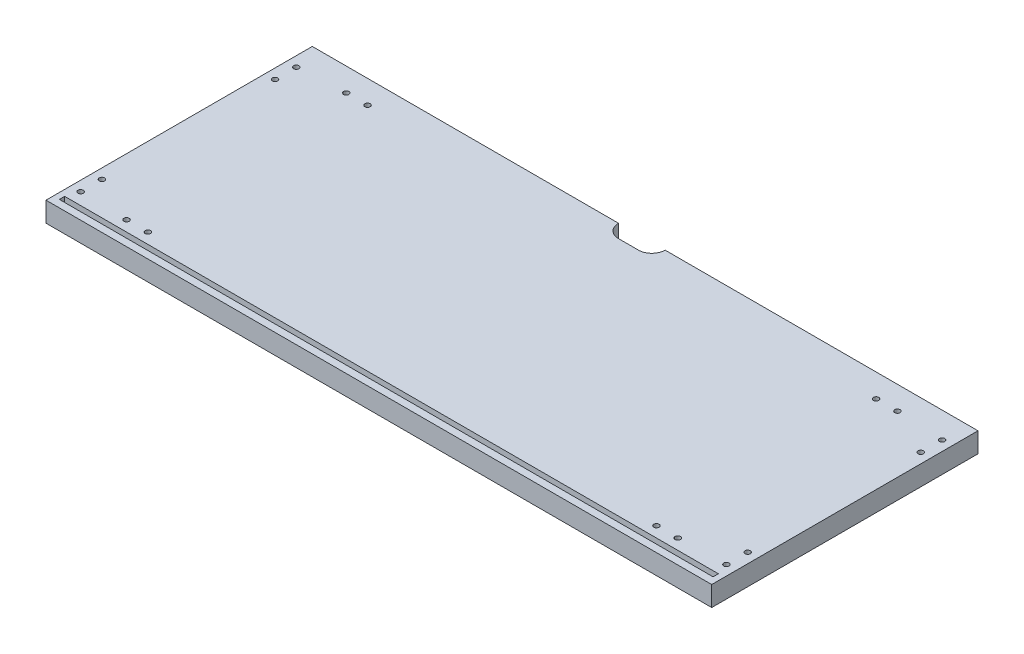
from build123d import *

# Parameters (mm, degrees)
ESQUISSE1_W             = 1000
ESQUISSE1_H             = 400
BOSS_EXTRU_1_DEPTH      = 30
ESQUISSE2_W             = 982
ESQUISSE2_H             = 8
ENL_V_MAT_EXTRU_1_DEPTH = 9
ENL_V_MAT_EXTRU_2_DEPTH = 540.351462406
ESQUISSE4_R             = 4
ENL_V_MAT_EXTRU_3_DEPTH = 540.351462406
ESQUISSE5_R             = 4
ENL_V_MAT_EXTRU_4_DEPTH = 9


with BuildPart() as part:
    # Esquisse1 → Boss.-Extru.1 (new body)
    with BuildSketch(Plane(origin=(0, 0, 0), x_dir=(1, 0, 0), z_dir=(0, 1, 0))):
        Rectangle(ESQUISSE1_W, ESQUISSE1_H)
    extrude(amount=BOSS_EXTRU_1_DEPTH)

    # Esquisse2 → Enl_v. mat.-Extru.1 (cut)
    with BuildSketch(Plane(origin=(0, 30, 0), x_dir=(1, 0, 0), z_dir=(0, 1, 0))):
        with Locations((0, -185)):
            Rectangle(ESQUISSE2_W, ESQUISSE2_H)
    extrude(amount=-ENL_V_MAT_EXTRU_1_DEPTH, mode=Mode.SUBTRACT)

    # Esquisse3 → Enl_v. mat.-Extru.2 (cut, through all)
    with BuildSketch(Plane(origin=(0, 30, 0), x_dir=(1, 0, 0), z_dir=(0, 1, 0))):
        with BuildLine():
            Line((-40, 200), (30, 200))
            ThreePointArc((30, 200), (24.142135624, 185.857864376), (10, 180))
            Line((10, 180), (-20, 180))
            ThreePointArc((-20, 180), (-34.142135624, 185.857864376), (-40, 200))
        make_face()
    extrude(amount=-ENL_V_MAT_EXTRU_2_DEPTH, mode=Mode.SUBTRACT)

    # Esquisse4 → Enl_v. mat.-Extru.3 (cut, through all)
    with BuildSketch(Plane(origin=(0, 30, 0), x_dir=(1, 0, 0), z_dir=(0, 1, 0))):
        with Locations(Location((-382, -165, 0), (0, 0, 270))):
            Circle(ESQUISSE4_R)
        with Locations(Location((-414, -165, 0), (0, 0, 270))):
            Circle(ESQUISSE4_R)
        with Locations(Location((-414, 165, 0), (0, 0, 270))):
            Circle(ESQUISSE4_R)
        with Locations(Location((-382, 165, 0), (0, 0, 270))):
            Circle(ESQUISSE4_R)
    enl_v_mat_extru_3 = extrude(amount=-ENL_V_MAT_EXTRU_3_DEPTH, mode=Mode.SUBTRACT)

    # Esquisse5 → Enl_v. mat.-Extru.4 (cut)
    with BuildSketch(Plane(origin=(0, 30, 0), x_dir=(1, 0, 0), z_dir=(0, 1, 0))):
        with Locations(Location((-485, -163, 0), (0, 0, 270))):
            Circle(ESQUISSE5_R)
        with Locations(Location((-485, -131, 0), (0, 0, 270))):
            Circle(ESQUISSE5_R)
        with Locations(Location((-485, 161, 0), (0, 0, 270))):
            Circle(ESQUISSE5_R)
        with Locations(Location((-485, 129, 0), (0, 0, 270))):
            Circle(ESQUISSE5_R)
    enl_v_mat_extru_4 = extrude(amount=-ENL_V_MAT_EXTRU_4_DEPTH, mode=Mode.SUBTRACT)

    # Sym_trie1: Enl_v. mat.-Extru.3, Enl_v. mat.-Extru.4 across plane
    add(enl_v_mat_extru_3.mirror(Plane(origin=(0, 0, 0), x_dir=(0, 0, 1), z_dir=(1, 0, 0))), mode=Mode.SUBTRACT)
    add(enl_v_mat_extru_4.mirror(Plane(origin=(0, 0, 0), x_dir=(0, 0, 1), z_dir=(1, 0, 0))), mode=Mode.SUBTRACT)


solid = part.part
